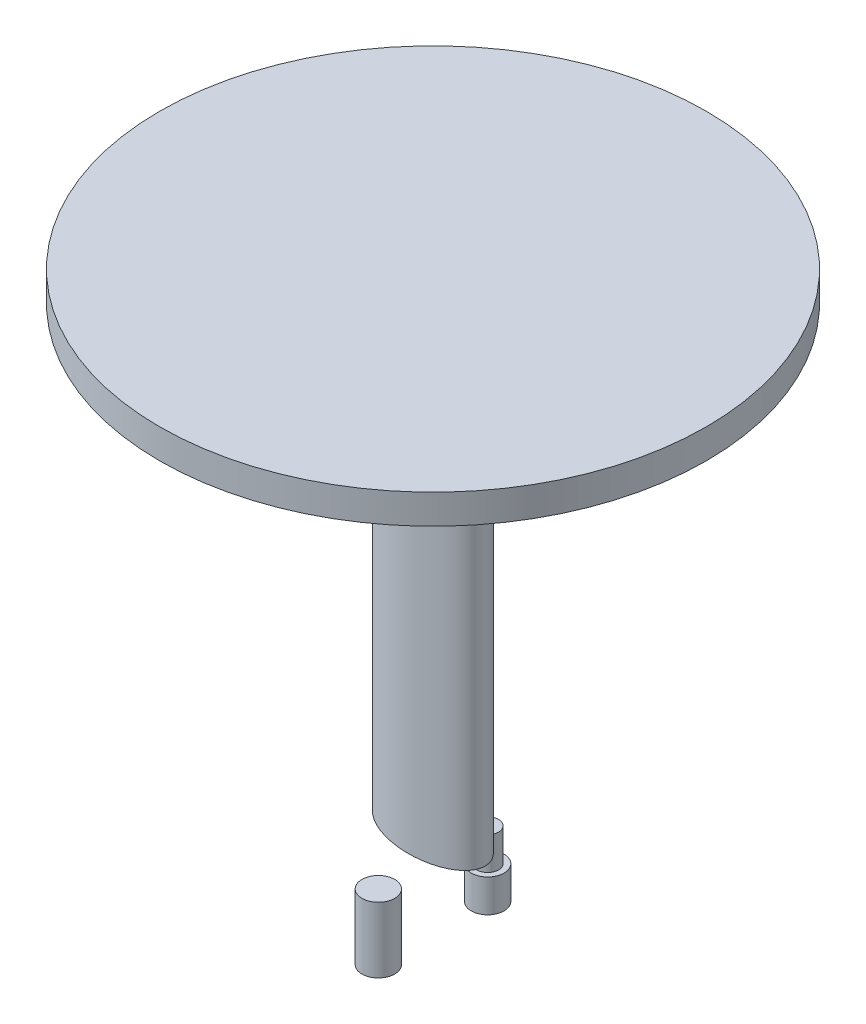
ISO-10303-21;
HEADER;
FILE_DESCRIPTION(('STEP AP214'),'2;1');
FILE_NAME('part.step','',(''),(''),'','','');
FILE_SCHEMA(('AUTOMOTIVE_DESIGN { 1 0 10303 214 1 1 1 1 }'));
ENDSEC;
DATA;
#1=APPLICATION_CONTEXT('core data for automotive mechanical design processes');
#2=APPLICATION_PROTOCOL_DEFINITION('international standard','automotive_design',2000,#1);
#3=PRODUCT_CONTEXT('',#1,'mechanical');
#4=PRODUCT('Part','Part','',(#3));
#5=PRODUCT_RELATED_PRODUCT_CATEGORY('part','',(#4));
#6=PRODUCT_DEFINITION_FORMATION('','',#4);
#7=PRODUCT_DEFINITION_CONTEXT('part definition',#1,'design');
#8=PRODUCT_DEFINITION('design','',#6,#7);
#9=PRODUCT_DEFINITION_SHAPE('','',#8);
#10=(LENGTH_UNIT() NAMED_UNIT(*) SI_UNIT(.MILLI.,.METRE.));
#11=(NAMED_UNIT(*) PLANE_ANGLE_UNIT() SI_UNIT($,.RADIAN.));
#12=(NAMED_UNIT(*) SI_UNIT($,.STERADIAN.) SOLID_ANGLE_UNIT());
#13=UNCERTAINTY_MEASURE_WITH_UNIT(LENGTH_MEASURE(1.E-05),#10,'distance_accuracy_value','');
#14=(GEOMETRIC_REPRESENTATION_CONTEXT(3) GLOBAL_UNCERTAINTY_ASSIGNED_CONTEXT((#13)) GLOBAL_UNIT_ASSIGNED_CONTEXT((#10,
#11,#12)) REPRESENTATION_CONTEXT('',''));
#15=CARTESIAN_POINT('',(0.,0.,0.));
#16=DIRECTION('',(0.,0.,1.));
#17=DIRECTION('',(1.,0.,0.));
#18=AXIS2_PLACEMENT_3D('',#15,#16,#17);
#19=CARTESIAN_POINT('',(0.,33.,0.));
#20=DIRECTION('',(0.,1.,0.));
#21=DIRECTION('',(0.995818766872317,0.,0.0913508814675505));
#22=AXIS2_PLACEMENT_3D('',#19,#20,#21);
#23=ELLIPSE('',#22,5.09444849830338,2.80852619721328);
#24=DIRECTION('',(0.,-1.,0.));
#25=VECTOR('',#24,1.);
#26=SURFACE_OF_LINEAR_EXTRUSION('',#23,#25);
#27=CARTESIAN_POINT('',(5.07314742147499,33.,0.465382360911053));
#28=VERTEX_POINT('',#27);
#29=EDGE_CURVE('E11',#28,#28,#23,.T.);
#30=ORIENTED_EDGE('',*,*,#29,.F.);
#31=EDGE_LOOP('',(#30));
#32=FACE_BOUND('',#31,.T.);
#33=CARTESIAN_POINT('',(0.,2.,0.));
#34=DIRECTION('',(0.,1.,0.));
#35=DIRECTION('',(0.995818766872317,0.,0.0913508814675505));
#36=AXIS2_PLACEMENT_3D('',#33,#34,#35);
#37=ELLIPSE('',#36,5.09444849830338,2.80852619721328);
#38=CARTESIAN_POINT('',(5.07314742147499,2.,0.465382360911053));
#39=VERTEX_POINT('',#38);
#40=EDGE_CURVE('E46',#39,#39,#37,.T.);
#41=ORIENTED_EDGE('',*,*,#40,.T.);
#42=EDGE_LOOP('',(#41));
#43=FACE_BOUND('',#42,.T.);
#44=ADVANCED_FACE('F42',(#32,#43),#26,.F.);
#45=CARTESIAN_POINT('',(0.,33.,0.));
#46=DIRECTION('',(0.,1.,0.));
#47=DIRECTION('',(0.,0.,1.));
#48=AXIS2_PLACEMENT_3D('',#45,#46,#47);
#49=PLANE('',#48);
#50=ORIENTED_EDGE('',*,*,#29,.T.);
#51=EDGE_LOOP('',(#50));
#52=FACE_BOUND('',#51,.T.);
#53=ADVANCED_FACE('F58',(#52),#49,.T.);
#54=CARTESIAN_POINT('',(0.,2.,0.));
#55=DIRECTION('',(0.,1.,0.));
#56=DIRECTION('',(0.,0.,1.));
#57=AXIS2_PLACEMENT_3D('',#54,#55,#56);
#58=PLANE('',#57);
#59=ORIENTED_EDGE('',*,*,#40,.F.);
#60=EDGE_LOOP('',(#59));
#61=FACE_BOUND('',#60,.T.);
#62=ADVANCED_FACE('F56',(#61),#58,.F.);
#63=CLOSED_SHELL('',(#44,#53,#62));
#64=MANIFOLD_SOLID_BREP('B2_NOT_SHOWN',#63);
#65=CARTESIAN_POINT('',(0.,-6.,-5.));
#66=DIRECTION('',(0.,1.,0.));
#67=DIRECTION('',(0.,0.,1.));
#68=AXIS2_PLACEMENT_3D('',#65,#66,#67);
#69=CYLINDRICAL_SURFACE('',#68,1.5);
#70=CARTESIAN_POINT('',(0.,-3.,-5.));
#71=DIRECTION('',(0.,-1.,0.));
#72=DIRECTION('',(0.,0.,-1.));
#73=AXIS2_PLACEMENT_3D('',#70,#71,#72);
#74=CIRCLE('',#73,1.5);
#75=CARTESIAN_POINT('',(0.,-3.,-6.5));
#76=VERTEX_POINT('',#75);
#77=EDGE_CURVE('E110',#76,#76,#74,.T.);
#78=ORIENTED_EDGE('',*,*,#77,.T.);
#79=EDGE_LOOP('',(#78));
#80=FACE_BOUND('',#79,.T.);
#81=CARTESIAN_POINT('',(0.,-6.,-5.));
#82=DIRECTION('',(0.,-1.,0.));
#83=DIRECTION('',(0.,0.,-1.));
#84=AXIS2_PLACEMENT_3D('',#81,#82,#83);
#85=CIRCLE('',#84,1.5);
#86=CARTESIAN_POINT('',(0.,-6.,-6.5));
#87=VERTEX_POINT('',#86);
#88=EDGE_CURVE('E41',#87,#87,#85,.T.);
#89=ORIENTED_EDGE('',*,*,#88,.F.);
#90=EDGE_LOOP('',(#89));
#91=FACE_BOUND('',#90,.T.);
#92=ADVANCED_FACE('F104',(#80,#91),#69,.T.);
#93=CARTESIAN_POINT('',(0.,-6.,-5.));
#94=DIRECTION('',(0.,-1.,0.));
#95=DIRECTION('',(0.,0.,-1.));
#96=AXIS2_PLACEMENT_3D('',#93,#94,#95);
#97=PLANE('',#96);
#98=ORIENTED_EDGE('',*,*,#88,.T.);
#99=EDGE_LOOP('',(#98));
#100=FACE_BOUND('',#99,.T.);
#101=ADVANCED_FACE('F137',(#100),#97,.T.);
#102=CARTESIAN_POINT('',(0.,-3.,-5.));
#103=DIRECTION('',(0.,-1.,0.));
#104=DIRECTION('',(0.,0.,-1.));
#105=AXIS2_PLACEMENT_3D('',#102,#103,#104);
#106=PLANE('',#105);
#107=CARTESIAN_POINT('',(0.,-3.,-5.));
#108=DIRECTION('',(0.,-1.,0.));
#109=DIRECTION('',(0.,0.,-1.));
#110=AXIS2_PLACEMENT_3D('',#107,#108,#109);
#111=CIRCLE('',#110,1.);
#112=CARTESIAN_POINT('',(0.,-3.,-6.));
#113=VERTEX_POINT('',#112);
#114=EDGE_CURVE('E118',#113,#113,#111,.T.);
#115=ORIENTED_EDGE('',*,*,#114,.T.);
#116=EDGE_LOOP('',(#115));
#117=FACE_BOUND('',#116,.T.);
#118=ORIENTED_EDGE('',*,*,#77,.F.);
#119=EDGE_LOOP('',(#118));
#120=FACE_BOUND('',#119,.T.);
#121=ADVANCED_FACE('F124',(#117,#120),#106,.F.);
#122=CARTESIAN_POINT('',(0.,0.,-5.));
#123=DIRECTION('',(0.,-1.,0.));
#124=DIRECTION('',(0.,0.,-1.));
#125=AXIS2_PLACEMENT_3D('',#122,#123,#124);
#126=CYLINDRICAL_SURFACE('',#125,1.);
#127=CARTESIAN_POINT('',(0.,0.,-5.));
#128=DIRECTION('',(0.,-1.,0.));
#129=DIRECTION('',(0.,0.,-1.));
#130=AXIS2_PLACEMENT_3D('',#127,#128,#129);
#131=CIRCLE('',#130,1.);
#132=CARTESIAN_POINT('',(0.,0.,-6.));
#133=VERTEX_POINT('',#132);
#134=EDGE_CURVE('E114',#133,#133,#131,.T.);
#135=ORIENTED_EDGE('',*,*,#134,.T.);
#136=EDGE_LOOP('',(#135));
#137=FACE_BOUND('',#136,.T.);
#138=ORIENTED_EDGE('',*,*,#114,.F.);
#139=EDGE_LOOP('',(#138));
#140=FACE_BOUND('',#139,.T.);
#141=ADVANCED_FACE('F127',(#137,#140),#126,.T.);
#142=CARTESIAN_POINT('',(0.,0.,-5.));
#143=DIRECTION('',(0.,-1.,0.));
#144=DIRECTION('',(0.,0.,-1.));
#145=AXIS2_PLACEMENT_3D('',#142,#143,#144);
#146=PLANE('',#145);
#147=ORIENTED_EDGE('',*,*,#134,.F.);
#148=EDGE_LOOP('',(#147));
#149=FACE_BOUND('',#148,.T.);
#150=ADVANCED_FACE('F129',(#149),#146,.F.);
#151=CLOSED_SHELL('',(#92,#101,#121,#141,#150));
#152=MANIFOLD_SOLID_BREP('B6_NOT_SHOWN',#151);
#153=CARTESIAN_POINT('',(0.,-6.,5.));
#154=DIRECTION('',(0.,1.,0.));
#155=DIRECTION('',(0.,0.,1.));
#156=AXIS2_PLACEMENT_3D('',#153,#154,#155);
#157=CYLINDRICAL_SURFACE('',#156,1.5);
#158=CARTESIAN_POINT('',(0.,-6.,5.));
#159=DIRECTION('',(0.,-1.,0.));
#160=DIRECTION('',(0.,0.,-1.));
#161=AXIS2_PLACEMENT_3D('',#158,#159,#160);
#162=CIRCLE('',#161,1.5);
#163=CARTESIAN_POINT('',(0.,-6.,3.5));
#164=VERTEX_POINT('',#163);
#165=EDGE_CURVE('E103',#164,#164,#162,.T.);
#166=ORIENTED_EDGE('',*,*,#165,.F.);
#167=EDGE_LOOP('',(#166));
#168=FACE_BOUND('',#167,.T.);
#169=CARTESIAN_POINT('',(0.,0.,5.));
#170=DIRECTION('',(0.,-1.,0.));
#171=DIRECTION('',(0.,0.,-1.));
#172=AXIS2_PLACEMENT_3D('',#169,#170,#171);
#173=CIRCLE('',#172,1.5);
#174=CARTESIAN_POINT('',(0.,0.,3.5));
#175=VERTEX_POINT('',#174);
#176=EDGE_CURVE('E185',#175,#175,#173,.T.);
#177=ORIENTED_EDGE('',*,*,#176,.T.);
#178=EDGE_LOOP('',(#177));
#179=FACE_BOUND('',#178,.T.);
#180=ADVANCED_FACE('F182',(#168,#179),#157,.T.);
#181=CARTESIAN_POINT('',(0.,-6.,5.));
#182=DIRECTION('',(0.,-1.,0.));
#183=DIRECTION('',(0.,0.,-1.));
#184=AXIS2_PLACEMENT_3D('',#181,#182,#183);
#185=PLANE('',#184);
#186=ORIENTED_EDGE('',*,*,#165,.T.);
#187=EDGE_LOOP('',(#186));
#188=FACE_BOUND('',#187,.T.);
#189=ADVANCED_FACE('F197',(#188),#185,.T.);
#190=CARTESIAN_POINT('',(0.,0.,5.));
#191=DIRECTION('',(0.,-1.,0.));
#192=DIRECTION('',(0.,0.,-1.));
#193=AXIS2_PLACEMENT_3D('',#190,#191,#192);
#194=PLANE('',#193);
#195=ORIENTED_EDGE('',*,*,#176,.F.);
#196=EDGE_LOOP('',(#195));
#197=FACE_BOUND('',#196,.T.);
#198=ADVANCED_FACE('F195',(#197),#194,.F.);
#199=CLOSED_SHELL('',(#180,#189,#198));
#200=MANIFOLD_SOLID_BREP('B36_NOT_SHOWN',#199);
#201=CARTESIAN_POINT('',(0.,0.,0.));
#202=DIRECTION('',(0.,-1.,0.));
#203=DIRECTION('',(0.,0.,-1.));
#204=AXIS2_PLACEMENT_3D('',#201,#202,#203);
#205=CYLINDRICAL_SURFACE('',#204,25.);
#206=CARTESIAN_POINT('',(0.,46.6,0.));
#207=DIRECTION('',(0.,-1.,0.));
#208=DIRECTION('',(0.,0.,-1.));
#209=AXIS2_PLACEMENT_3D('',#206,#207,#208);
#210=CIRCLE('',#209,25.);
#211=CARTESIAN_POINT('',(0.,46.6,-25.));
#212=VERTEX_POINT('',#211);
#213=EDGE_CURVE('E229',#212,#212,#210,.T.);
#214=ORIENTED_EDGE('',*,*,#213,.T.);
#215=EDGE_LOOP('',(#214));
#216=FACE_BOUND('',#215,.T.);
#217=CARTESIAN_POINT('',(0.,43.9,0.));
#218=DIRECTION('',(0.,-1.,0.));
#219=DIRECTION('',(0.,0.,-1.));
#220=AXIS2_PLACEMENT_3D('',#217,#218,#219);
#221=CIRCLE('',#220,25.);
#222=CARTESIAN_POINT('',(0.,43.9,-25.));
#223=VERTEX_POINT('',#222);
#224=EDGE_CURVE('E181',#223,#223,#221,.T.);
#225=ORIENTED_EDGE('',*,*,#224,.F.);
#226=EDGE_LOOP('',(#225));
#227=FACE_BOUND('',#226,.T.);
#228=ADVANCED_FACE('F223',(#216,#227),#205,.T.);
#229=CARTESIAN_POINT('',(23.5,43.9,0.));
#230=DIRECTION('',(0.,-1.,0.));
#231=DIRECTION('',(0.,0.,-1.));
#232=AXIS2_PLACEMENT_3D('',#229,#230,#231);
#233=PLANE('',#232);
#234=ORIENTED_EDGE('',*,*,#224,.T.);
#235=EDGE_LOOP('',(#234));
#236=FACE_BOUND('',#235,.T.);
#237=ADVANCED_FACE('F239',(#236),#233,.T.);
#238=CARTESIAN_POINT('',(23.5,46.6,0.));
#239=DIRECTION('',(0.,1.,0.));
#240=DIRECTION('',(0.,0.,1.));
#241=AXIS2_PLACEMENT_3D('',#238,#239,#240);
#242=PLANE('',#241);
#243=ORIENTED_EDGE('',*,*,#213,.F.);
#244=EDGE_LOOP('',(#243));
#245=FACE_BOUND('',#244,.T.);
#246=ADVANCED_FACE('F237',(#245),#242,.T.);
#247=CLOSED_SHELL('',(#228,#237,#246));
#248=MANIFOLD_SOLID_BREP('B98',#247);
#249=ADVANCED_BREP_SHAPE_REPRESENTATION('',(#18,#64,#152,#200,#248),#14);
#250=SHAPE_DEFINITION_REPRESENTATION(#9,#249);
ENDSEC;
END-ISO-10303-21;
